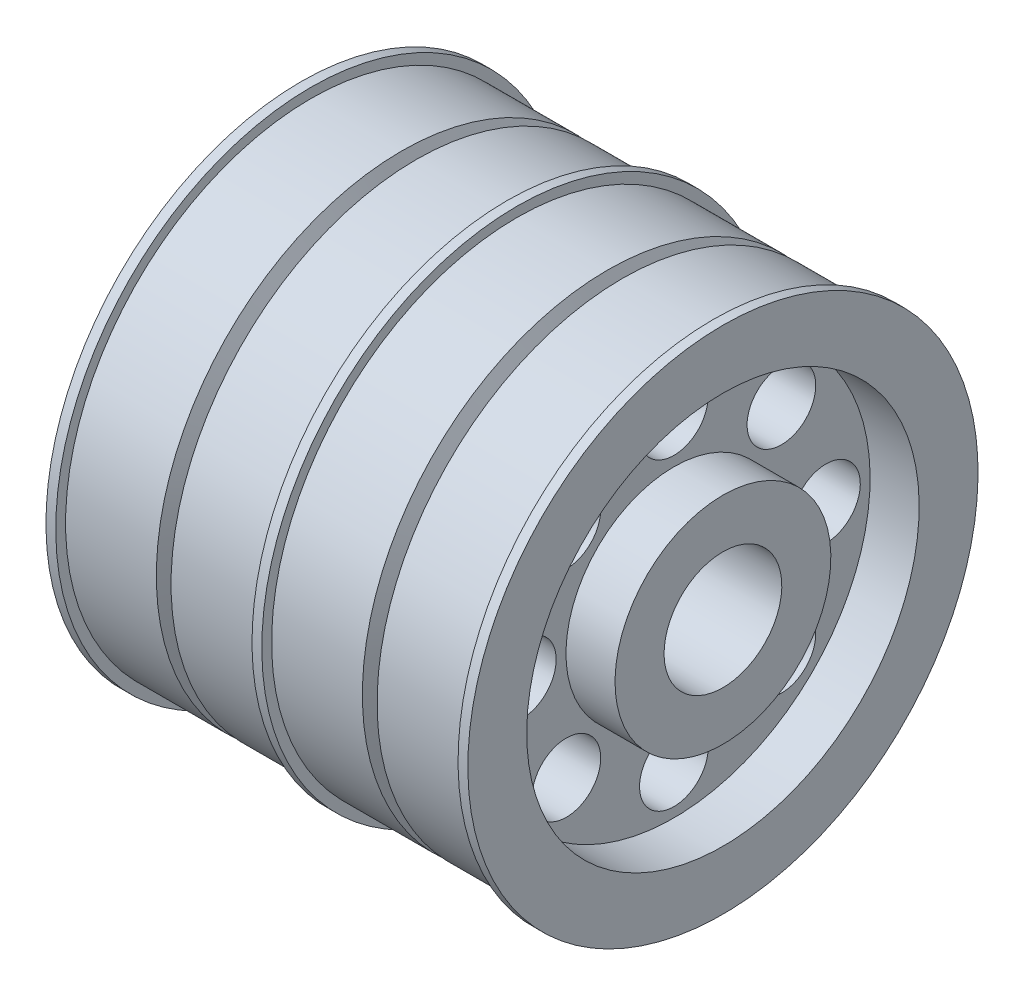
from build123d import *

# Parameters (mm, degrees)
SKETCH4_R          = 7
CUT_EXTRUDE1_DEPTH = 113.142766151


with BuildPart() as part:
    # Sketch1 → Revolve1 (revolve)
    with BuildSketch(Plane.XY):
        Polygon((0, 10), (0, 0), (86, 0), (86, 10), (76, 10), (76, 28), (86, 28), (86, 38), (86, 40), (84, 40), (84, 38), (65.5, 38), (64, 35), (62.5, 38), (44, 38), (44, 40), (42, 40), (42, 38), (23.5, 38), (22, 35), (20.5, 38), (2, 38), (2, 40), (0, 40), (0, 38), (0, 28), (10, 28), (10, 10), align=None)
    revolve(axis=Axis((66.391620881, -12, 0), (-1, 0, 0)))

    # Sketch4 → Cut-Extrude1 (cut, through all)
    with BuildSketch(Plane(origin=(76, 0, 0), x_dir=(0, 0, -1), z_dir=(1, 0, 0))):
        with Locations(Location((-21.920310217, 9.920310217, 0), (0, 0, 90))):
            Circle(SKETCH4_R)
        with BuildLine():
            ThreePointArc((0, 26), (-7, 19), (0, 12))
            Line((0, 12), (0, 26))
        make_face()
        with BuildLine():
            Line((0, 26), (0, 12))
            ThreePointArc((0, 12), (4.949747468, 14.050252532), (7, 19))
            ThreePointArc((7, 19), (4.949747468, 23.949747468), (0, 26))
        make_face()
        with Locations(Location((-31, -12, 0), (0, 0, 90))):
            Circle(SKETCH4_R)
        with Locations(Location((-21.920310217, -33.920310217, 0), (0, 0, 90))):
            Circle(SKETCH4_R)
        with Locations(Location((0, -43, 0), (0, 0, 90))):
            Circle(SKETCH4_R)
        with Locations(Location((21.920310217, -33.920310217, 0), (0, 0, 90))):
            Circle(SKETCH4_R)
        with Locations(Location((31, -12, 0), (0, 0, 90))):
            Circle(SKETCH4_R)
        with Locations(Location((21.920310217, 9.920310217, 0), (0, 0, 90))):
            Circle(SKETCH4_R)
        with BuildLine():
            ThreePointArc((0, 26), (-7, 19), (0, 12))
            Line((0, 12), (0, 26))
        make_face()
        with BuildLine():
            Line((0, 26), (0, 12))
            ThreePointArc((0, 12), (4.949747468, 14.050252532), (7, 19))
            ThreePointArc((7, 19), (4.949747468, 23.949747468), (0, 26))
        make_face()
    extrude(amount=-CUT_EXTRUDE1_DEPTH, mode=Mode.SUBTRACT)


solid = part.part
